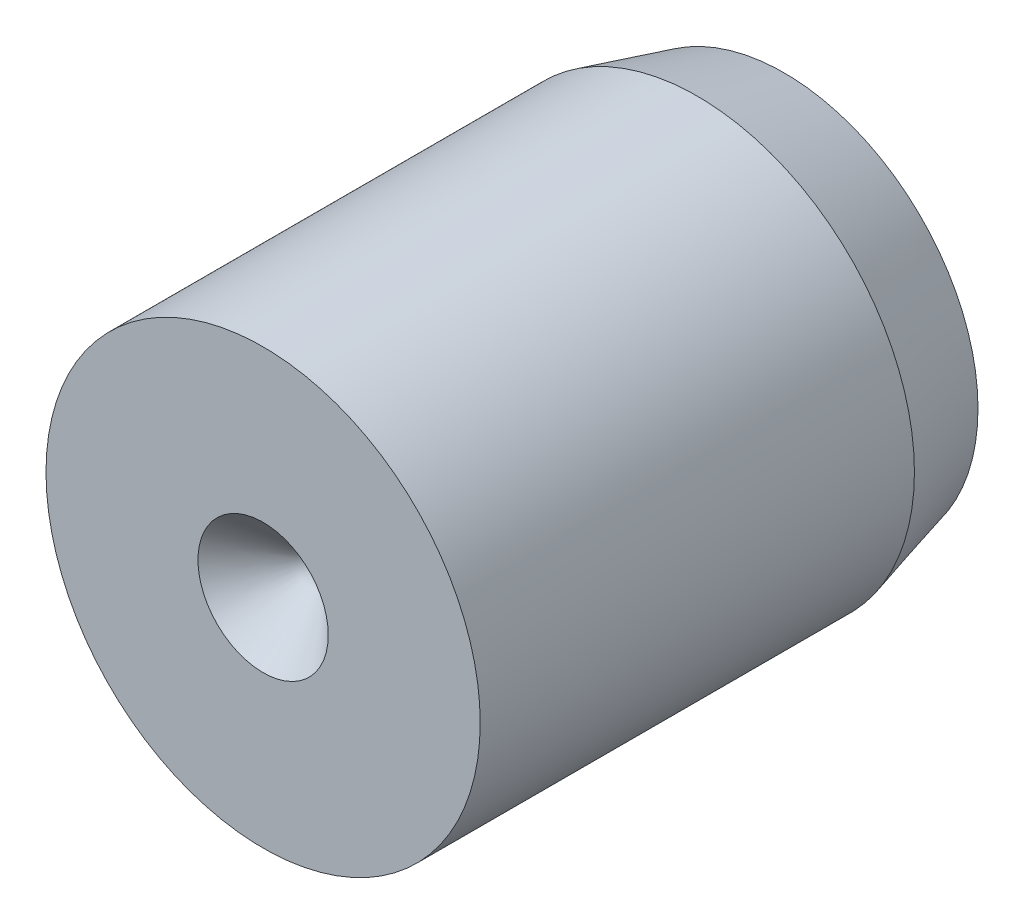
ISO-10303-21;
HEADER;
FILE_DESCRIPTION(('STEP AP214'),'2;1');
FILE_NAME('part.step','',(''),(''),'','','');
FILE_SCHEMA(('AUTOMOTIVE_DESIGN { 1 0 10303 214 1 1 1 1 }'));
ENDSEC;
DATA;
#1=APPLICATION_CONTEXT('core data for automotive mechanical design processes');
#2=APPLICATION_PROTOCOL_DEFINITION('international standard','automotive_design',2000,#1);
#3=PRODUCT_CONTEXT('',#1,'mechanical');
#4=PRODUCT('Part','Part','',(#3));
#5=PRODUCT_RELATED_PRODUCT_CATEGORY('part','',(#4));
#6=PRODUCT_DEFINITION_FORMATION('','',#4);
#7=PRODUCT_DEFINITION_CONTEXT('part definition',#1,'design');
#8=PRODUCT_DEFINITION('design','',#6,#7);
#9=PRODUCT_DEFINITION_SHAPE('','',#8);
#10=(LENGTH_UNIT() NAMED_UNIT(*) SI_UNIT(.MILLI.,.METRE.));
#11=(NAMED_UNIT(*) PLANE_ANGLE_UNIT() SI_UNIT($,.RADIAN.));
#12=(NAMED_UNIT(*) SI_UNIT($,.STERADIAN.) SOLID_ANGLE_UNIT());
#13=UNCERTAINTY_MEASURE_WITH_UNIT(LENGTH_MEASURE(1.E-05),#10,'distance_accuracy_value','');
#14=(GEOMETRIC_REPRESENTATION_CONTEXT(3) GLOBAL_UNCERTAINTY_ASSIGNED_CONTEXT((#13)) GLOBAL_UNIT_ASSIGNED_CONTEXT((#10,
#11,#12)) REPRESENTATION_CONTEXT('',''));
#15=CARTESIAN_POINT('',(0.,0.,0.));
#16=DIRECTION('',(0.,0.,1.));
#17=DIRECTION('',(1.,0.,0.));
#18=AXIS2_PLACEMENT_3D('',#15,#16,#17);
#19=CARTESIAN_POINT('',(0.,2.5,6.));
#20=DIRECTION('',(0.,0.,-1.));
#21=DIRECTION('',(-1.,0.,0.));
#22=AXIS2_PLACEMENT_3D('',#19,#20,#21);
#23=PLANE('',#22);
#24=CARTESIAN_POINT('',(0.,0.,6.));
#25=DIRECTION('',(0.,0.,1.));
#26=DIRECTION('',(1.,0.,0.));
#27=AXIS2_PLACEMENT_3D('',#24,#25,#26);
#28=CIRCLE('',#27,0.75);
#29=CARTESIAN_POINT('',(0.75,0.,6.));
#30=VERTEX_POINT('',#29);
#31=EDGE_CURVE('E9',#30,#30,#28,.T.);
#32=ORIENTED_EDGE('',*,*,#31,.F.);
#33=EDGE_LOOP('',(#32));
#34=FACE_BOUND('',#33,.T.);
#35=CARTESIAN_POINT('',(0.,0.,6.));
#36=DIRECTION('',(0.,0.,1.));
#37=DIRECTION('',(1.,0.,0.));
#38=AXIS2_PLACEMENT_3D('',#35,#36,#37);
#39=CIRCLE('',#38,2.5);
#40=CARTESIAN_POINT('',(2.5,0.,6.));
#41=VERTEX_POINT('',#40);
#42=EDGE_CURVE('E33',#41,#41,#39,.T.);
#43=ORIENTED_EDGE('',*,*,#42,.T.);
#44=EDGE_LOOP('',(#43));
#45=FACE_BOUND('',#44,.T.);
#46=ADVANCED_FACE('F14',(#34,#45),#23,.F.);
#47=CARTESIAN_POINT('',(0.,0.,6.));
#48=DIRECTION('',(0.,0.,1.));
#49=DIRECTION('',(1.,0.,0.));
#50=AXIS2_PLACEMENT_3D('',#47,#48,#49);
#51=CONICAL_SURFACE('',#50,0.75,0.78539816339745);
#52=CARTESIAN_POINT('',(0.,0.,5.25));
#53=VERTEX_POINT('',#52);
#54=VERTEX_LOOP('',#53);
#55=FACE_BOUND('',#54,.T.);
#56=ORIENTED_EDGE('',*,*,#31,.T.);
#57=EDGE_LOOP('',(#56));
#58=FACE_BOUND('',#57,.T.);
#59=ADVANCED_FACE('F23',(#55,#58),#51,.F.);
#60=CARTESIAN_POINT('',(0.,2.23205080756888,0.));
#61=DIRECTION('',(0.,0.,-1.));
#62=DIRECTION('',(-1.,0.,0.));
#63=AXIS2_PLACEMENT_3D('',#60,#61,#62);
#64=PLANE('',#63);
#65=CARTESIAN_POINT('',(0.,0.,0.));
#66=DIRECTION('',(0.,0.,1.));
#67=DIRECTION('',(1.,0.,0.));
#68=AXIS2_PLACEMENT_3D('',#65,#66,#67);
#69=CIRCLE('',#68,2.23205080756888);
#70=CARTESIAN_POINT('',(2.23205080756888,0.,0.));
#71=VERTEX_POINT('',#70);
#72=EDGE_CURVE('E20',#71,#71,#69,.T.);
#73=ORIENTED_EDGE('',*,*,#72,.F.);
#74=EDGE_LOOP('',(#73));
#75=FACE_BOUND('',#74,.T.);
#76=ADVANCED_FACE('F26',(#75),#64,.T.);
#77=CARTESIAN_POINT('',(0.,0.,1.));
#78=DIRECTION('',(0.,0.,1.));
#79=DIRECTION('',(1.,0.,0.));
#80=AXIS2_PLACEMENT_3D('',#77,#78,#79);
#81=CONICAL_SURFACE('',#80,2.5,0.26179938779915);
#82=ORIENTED_EDGE('',*,*,#72,.T.);
#83=EDGE_LOOP('',(#82));
#84=FACE_BOUND('',#83,.T.);
#85=CARTESIAN_POINT('',(0.,0.,1.));
#86=DIRECTION('',(0.,0.,1.));
#87=DIRECTION('',(1.,0.,0.));
#88=AXIS2_PLACEMENT_3D('',#85,#86,#87);
#89=CIRCLE('',#88,2.5);
#90=CARTESIAN_POINT('',(2.5,0.,1.));
#91=VERTEX_POINT('',#90);
#92=EDGE_CURVE('E35',#91,#91,#89,.T.);
#93=ORIENTED_EDGE('',*,*,#92,.F.);
#94=EDGE_LOOP('',(#93));
#95=FACE_BOUND('',#94,.T.);
#96=ADVANCED_FACE('F42',(#84,#95),#81,.T.);
#97=CARTESIAN_POINT('',(0.,0.,7.));
#98=DIRECTION('',(0.,0.,1.));
#99=DIRECTION('',(1.,0.,0.));
#100=AXIS2_PLACEMENT_3D('',#97,#98,#99);
#101=CYLINDRICAL_SURFACE('',#100,2.5);
#102=ORIENTED_EDGE('',*,*,#92,.T.);
#103=EDGE_LOOP('',(#102));
#104=FACE_BOUND('',#103,.T.);
#105=ORIENTED_EDGE('',*,*,#42,.F.);
#106=EDGE_LOOP('',(#105));
#107=FACE_BOUND('',#106,.T.);
#108=ADVANCED_FACE('F51',(#104,#107),#101,.T.);
#109=CLOSED_SHELL('',(#46,#59,#76,#96,#108));
#110=MANIFOLD_SOLID_BREP('B1',#109);
#111=ADVANCED_BREP_SHAPE_REPRESENTATION('',(#18,#110),#14);
#112=SHAPE_DEFINITION_REPRESENTATION(#9,#111);
ENDSEC;
END-ISO-10303-21;
